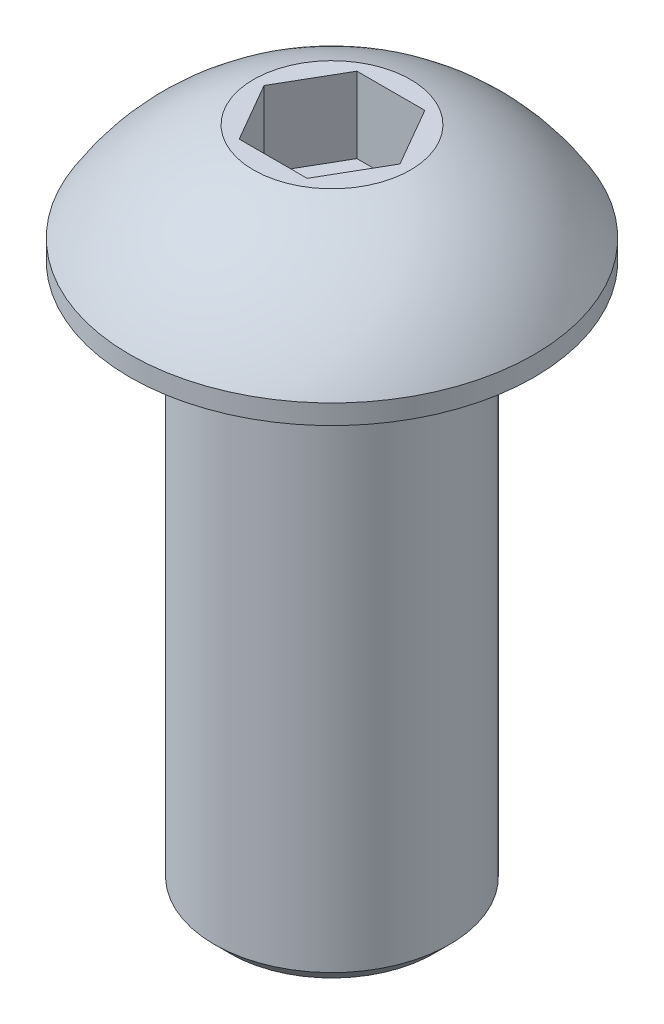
from build123d import *

# Parameters (mm, degrees)
CUT_EXTRUDE1_DEPTH  = 1.9304
SKETCH3_R           = 3
BOSS_EXTRUDE1_DEPTH = 14
FILLET1_R           = 0.4572
CHAMFER1_SIZE       = 0.4064


with BuildPart() as part:
    # Sketch1 → Base-Revolve (revolve)
    with BuildSketch(Plane.XY, mode=Mode.PRIVATE) as base_revolve_sk:
        with BuildLine():
            Line((5.15, 0), (0, 0))
            Line((0, 0), (0, 3))
            Line((0, 3), (2, 3))
            ThreePointArc((2, 3), (3.804445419, 2.039101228), (5.15, 0.5))
            Line((5.15, 0.5), (5.15, 0))
        make_face()
    revolve(base_revolve_sk.sketch.rotate(Axis((0, 2.464134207, 0), (0, -1, 0)), 90), axis=Axis((0, 2.464134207, 0), (0, -1, 0)))

    # Sketch2 → Cut-Extrude1 (cut)
    with BuildSketch(Plane(origin=(0, 3, 0), x_dir=(-1, 0, 0), z_dir=(0, 1, 0))):
        Polygon((0.866025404, -1.5), (1.732050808, 0), (0.866025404, 1.5), (-0.866025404, 1.5), (-1.732050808, 0), (-0.866025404, -1.5), align=None)
    extrude(amount=-CUT_EXTRUDE1_DEPTH, mode=Mode.SUBTRACT)

    # Sketch3 → Boss-Extrude1 (add)
    with BuildSketch(Plane.XZ):
        with Locations(Location((0, 0, 0), (0, 0, 90))):
            Circle(SKETCH3_R)
    extrude(amount=BOSS_EXTRUDE1_DEPTH)

    # Fillet1
    fillet1_edges = [part.edges().sort_by_distance(p)[0] for p in [
        (0, 0, -3),
    ]]
    fillet(fillet1_edges, radius=FILLET1_R)

    # Chamfer1
    chamfer1_edges = [part.edges().sort_by_distance(p)[0] for p in [
        (0, -14, -3),
    ]]
    chamfer(chamfer1_edges, length=CHAMFER1_SIZE)


solid = part.part
